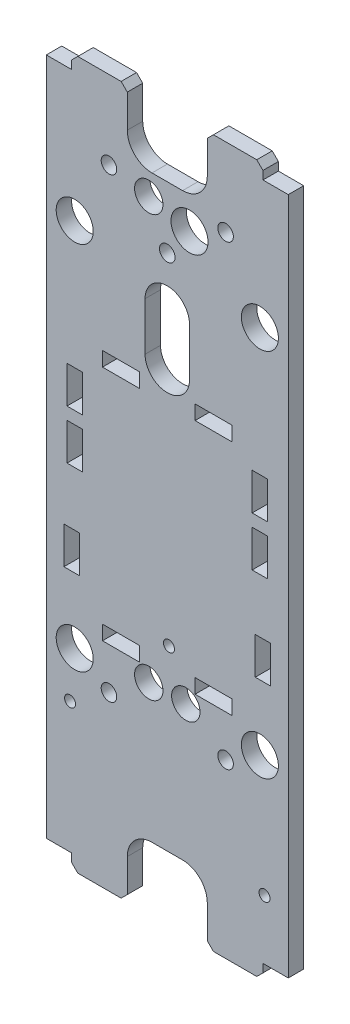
from build123d import *

# Parameters (mm, degrees)
SKETCH1_W                 = 49.784
SKETCH1_H                 = 145.542
BOSS_EXTRUDE1_DEPTH       = 3.175
SKETCH2_W                 = 16.4592
SKETCH2_H                 = 5.9436
SKETCH2_W_2               = 10.414
CUT_EXTRUDE1_DEPTH        = 77.976039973
CUT_EXTRUDE2_DEPTH        = 77.976039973
M3_CLEARANCE_HOLE1_D      = 3.2
TAP_DRILL_FOR_4_40_TAP1_D = 2.2606
F_2_CLEARANCE_HOLE1_D     = 2.2606
SKETCH9_W                 = 3.175
SKETCH9_H                 = 7.62
SKETCH9_W_2               = 7.62
SKETCH9_H_2               = 2.9718
CUT_EXTRUDE3_DEPTH        = 77.976039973
CUT_EXTRUDE4_DEPTH        = 77.976039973
SKETCH11_R                = 3.81
SKETCH11_R_2              = 2.921
CUT_EXTRUDE5_DEPTH        = 77.976039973
SKETCH12_R                = 3.81
CUT_EXTRUDE6_DEPTH        = 77.976039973
SKETCH13_W                = 3.175
SKETCH13_H                = 7.62
SKETCH13_W_2              = 7.62
SKETCH13_H_2              = 2.9718
CUT_EXTRUDE7_DEPTH        = 77.976039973
CHAMFER1_SIZE             = 1.27


with BuildPart() as part:
    # Sketch1 → Boss-Extrude1 (new body)
    with BuildSketch(Plane.XY):
        Rectangle(SKETCH1_W, SKETCH1_H)
    extrude(amount=BOSS_EXTRUDE1_DEPTH)

    # Sketch2 → Cut-Extrude1 (cut, through all)
    with BuildSketch(Plane(origin=(0, 0, 0), x_dir=(-1, 0, 0), z_dir=(0, 0, -1))):
        with Locations((0, 72.771)):
            Rectangle(SKETCH2_W, SKETCH2_H)
        with Locations((-24.892, 72.771)):
            Rectangle(SKETCH2_W_2, SKETCH2_H)
        with Locations((24.892, 72.771)):
            Rectangle(SKETCH2_W_2, SKETCH2_H)
        with Locations((24.892, -72.771)):
            Rectangle(SKETCH2_W_2, SKETCH2_H)
        with Locations((-24.892, -72.771)):
            Rectangle(SKETCH2_W_2, SKETCH2_H)
        with Locations((0, -72.771)):
            Rectangle(SKETCH2_W, SKETCH2_H)
    extrude(amount=-CUT_EXTRUDE1_DEPTH, mode=Mode.SUBTRACT)

    # Sketch3 → Cut-Extrude2 (cut, through all)
    with BuildSketch(Plane(origin=(0, 0, 0), x_dir=(-1, 0, 0), z_dir=(0, 0, -1))):
        with BuildLine():
            Line((-8.2296, 79.9592), (8.2296, 79.9592))
            Line((8.2296, 79.9592), (8.2296, 64.7192))
            ThreePointArc((8.2296, 64.7192), (6.741702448, 61.127097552), (3.1496, 59.6392))
            Line((3.1496, 59.6392), (-3.1496, 59.6392))
            ThreePointArc((-3.1496, 59.6392), (-6.741702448, 61.127097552), (-8.2296, 64.7192))
            Line((-8.2296, 64.7192), (-8.2296, 79.9592))
        make_face()
        with BuildLine():
            Line((8.2296, -79.9592), (8.2296, -64.7192))
            ThreePointArc((8.2296, -64.7192), (6.741702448, -61.127097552), (3.1496, -59.6392))
            Line((3.1496, -59.6392), (-3.1496, -59.6392))
            ThreePointArc((-3.1496, -59.6392), (-6.741702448, -61.127097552), (-8.2296, -64.7192))
            Line((-8.2296, -64.7192), (-8.2296, -79.9592))
            Line((-8.2296, -79.9592), (8.2296, -79.9592))
        make_face()
    extrude(amount=-CUT_EXTRUDE2_DEPTH, mode=Mode.SUBTRACT)

    # M3 Clearance Hole1 (through all)
    with Locations(Plane.XY.offset(3.175)):
        with Locations((0, 46.9392), (-12, 56.6392), (12, 56.6392), (12, -37.3608), (-12, -37.3608)):
            Hole(M3_CLEARANCE_HOLE1_D / 2)

    # Tap Drill for _4-40 Tap1 (through all)
    with Locations(Plane.XY.offset(3.175)):
        with Locations((0.348448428, -22.9108)):
            Hole(TAP_DRILL_FOR_4_40_TAP1_D / 2)

    # 2 Clearance Hole1 (through all)
    with Locations(Plane.XY.offset(3.175)):
        with Locations((20.005, -57.526), (-20.005, -42.91600002)):
            Hole(F_2_CLEARANCE_HOLE1_D / 2)

    # Sketch9 → Cut-Extrude3 (cut, through all)
    with BuildSketch(Plane.XY.offset(3.175)):
        with Locations((-19.05, 13.165289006)):
            Rectangle(SKETCH9_W, SKETCH9_H)
        with Locations((-9.525, 21.432432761)):
            Rectangle(SKETCH9_W_2, SKETCH9_H_2)
        with Locations((19.05, 13.165289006)):
            Rectangle(SKETCH9_W, SKETCH9_H)
        with Locations((19.05, 3.005289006)):
            Rectangle(SKETCH9_W, SKETCH9_H)
        with Locations((-19.05, 3.005289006)):
            Rectangle(SKETCH9_W, SKETCH9_H)
        with Locations((9.525, 21.432432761)):
            Rectangle(SKETCH9_W_2, SKETCH9_H_2)
    extrude(amount=-CUT_EXTRUDE3_DEPTH, mode=Mode.SUBTRACT)

    # Sketch10 → Cut-Extrude4 (cut, through all)
    with BuildSketch(Plane.XY.offset(3.175)):
        with BuildLine():
            Line((4.572, 36.5252), (4.572, 26.6192))
            ThreePointArc((4.572, 26.6192), (0, 22.0472), (-4.572, 26.6192))
            Line((-4.572, 26.6192), (-4.572, 36.5252))
            ThreePointArc((-4.572, 36.5252), (0, 41.0972), (4.572, 36.5252))
        make_face()
    extrude(amount=-CUT_EXTRUDE4_DEPTH, mode=Mode.SUBTRACT)

    # Sketch11 → Cut-Extrude5 (cut, through all)
    with BuildSketch(Plane.XY.offset(3.175)):
        with Locations((4.572, 53.086)):
            Circle(SKETCH11_R)
        with Locations((-3.81, 55.118)):
            Circle(SKETCH11_R_2)
        with Locations((3.81, -31.496)):
            Circle(SKETCH11_R_2)
        with Locations((-3.81, -31.496)):
            Circle(SKETCH11_R_2)
    extrude(amount=-CUT_EXTRUDE5_DEPTH, mode=Mode.SUBTRACT)

    # Sketch12 → Cut-Extrude6 (cut, through all)
    with BuildSketch(Plane.XY.offset(3.175)):
        with Locations((19.05, 43.18)):
            Circle(SKETCH12_R)
        with Locations((-19.05, 43.18)):
            Circle(SKETCH12_R)
        with Locations((19.05, -33.02)):
            Circle(SKETCH12_R)
        with Locations((-19.05, -33.02)):
            Circle(SKETCH12_R)
    extrude(amount=-CUT_EXTRUDE6_DEPTH, mode=Mode.SUBTRACT)

    # Sketch13 → Cut-Extrude7 (cut, through all)
    with BuildSketch(Plane.XY.offset(3.175)):
        with Locations((-19.685, -15.785564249)):
            Rectangle(SKETCH13_W, SKETCH13_H)
        with Locations((9.525, -27.335977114)):
            Rectangle(SKETCH13_W_2, SKETCH13_H_2)
        with Locations((19.685, -15.785564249)):
            Rectangle(SKETCH13_W, SKETCH13_H)
        with Locations((-9.525, -27.335977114)):
            Rectangle(SKETCH13_W_2, SKETCH13_H_2)
    extrude(amount=-CUT_EXTRUDE7_DEPTH, mode=Mode.SUBTRACT)

    # Chamfer1
    chamfer1_edges = [part.edges().sort_by_distance(p)[0] for p in [
        (19.685, 72.771, 1.5875),
        (-19.685, 72.771, 1.5875),
        (-19.685, -72.771, 1.5875),
        (19.685, -72.771, 1.5875),
        (8.2296, -72.771, 1.5875),
        (-8.2296, -72.771, 1.5875),
        (-8.2296, 72.771, 1.5875),
        (8.2296, 72.771, 1.5875),
    ]]
    chamfer(chamfer1_edges, length=CHAMFER1_SIZE)


solid = part.part
